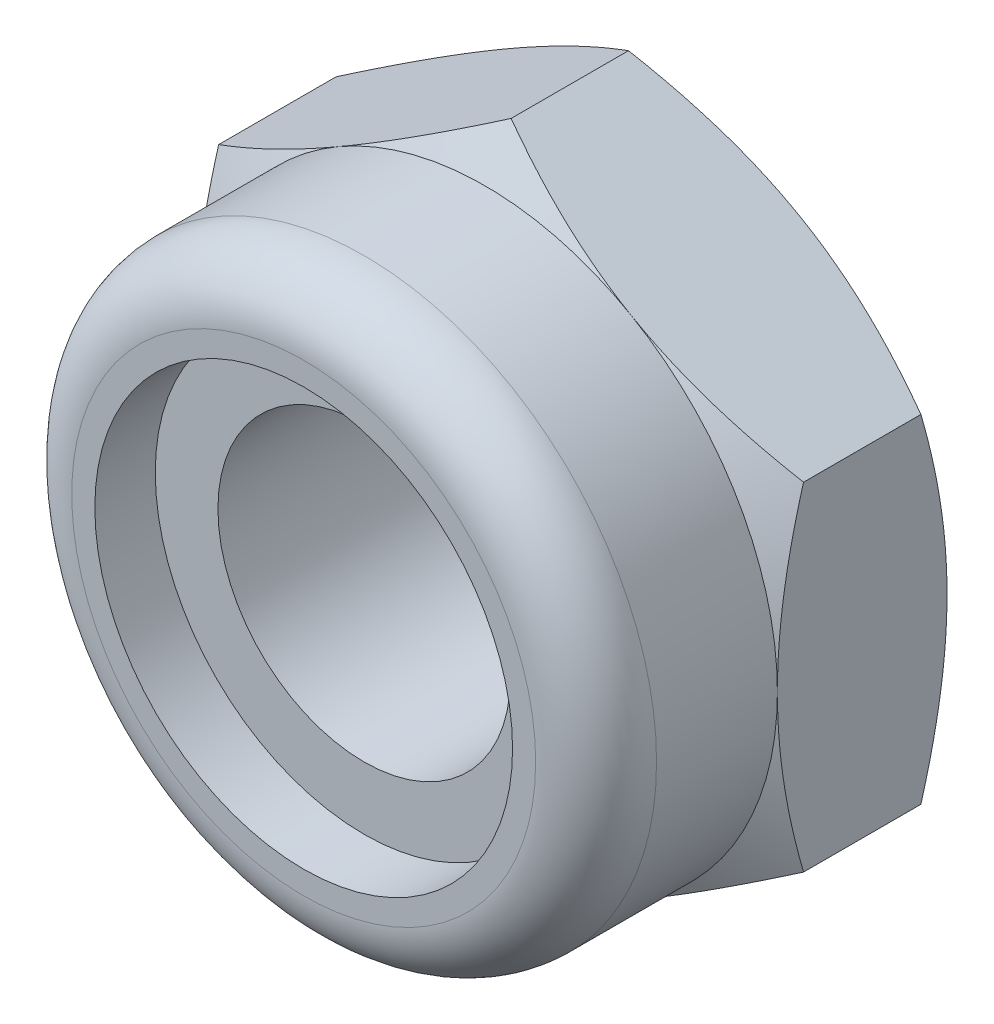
ISO-10303-21;
HEADER;
FILE_DESCRIPTION(('STEP AP214'),'2;1');
FILE_NAME('part.step','',(''),(''),'','','');
FILE_SCHEMA(('AUTOMOTIVE_DESIGN { 1 0 10303 214 1 1 1 1 }'));
ENDSEC;
DATA;
#1=APPLICATION_CONTEXT('core data for automotive mechanical design processes');
#2=APPLICATION_PROTOCOL_DEFINITION('international standard','automotive_design',2000,#1);
#3=PRODUCT_CONTEXT('',#1,'mechanical');
#4=PRODUCT('Part','Part','',(#3));
#5=PRODUCT_RELATED_PRODUCT_CATEGORY('part','',(#4));
#6=PRODUCT_DEFINITION_FORMATION('','',#4);
#7=PRODUCT_DEFINITION_CONTEXT('part definition',#1,'design');
#8=PRODUCT_DEFINITION('design','',#6,#7);
#9=PRODUCT_DEFINITION_SHAPE('','',#8);
#10=(LENGTH_UNIT() NAMED_UNIT(*) SI_UNIT(.MILLI.,.METRE.));
#11=(NAMED_UNIT(*) PLANE_ANGLE_UNIT() SI_UNIT($,.RADIAN.));
#12=(NAMED_UNIT(*) SI_UNIT($,.STERADIAN.) SOLID_ANGLE_UNIT());
#13=UNCERTAINTY_MEASURE_WITH_UNIT(LENGTH_MEASURE(1.E-05),#10,'distance_accuracy_value','');
#14=(GEOMETRIC_REPRESENTATION_CONTEXT(3) GLOBAL_UNCERTAINTY_ASSIGNED_CONTEXT((#13)) GLOBAL_UNIT_ASSIGNED_CONTEXT((#10,
#11,#12)) REPRESENTATION_CONTEXT('',''));
#15=CARTESIAN_POINT('',(0.,0.,0.));
#16=DIRECTION('',(0.,0.,1.));
#17=DIRECTION('',(1.,0.,0.));
#18=AXIS2_PLACEMENT_3D('',#15,#16,#17);
#19=CARTESIAN_POINT('',(0.,0.,-2.9));
#20=DIRECTION('',(0.,0.,1.));
#21=DIRECTION('',(1.,0.,0.));
#22=AXIS2_PLACEMENT_3D('',#19,#20,#21);
#23=CYLINDRICAL_SURFACE('',#22,2.5);
#24=CARTESIAN_POINT('',(0.,0.,2.06666666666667));
#25=DIRECTION('',(0.,0.,1.));
#26=DIRECTION('',(1.,0.,0.));
#27=AXIS2_PLACEMENT_3D('',#24,#25,#26);
#28=CIRCLE('',#27,2.5);
#29=CARTESIAN_POINT('',(2.5,0.,2.06666666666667));
#30=VERTEX_POINT('',#29);
#31=EDGE_CURVE('E274',#30,#30,#28,.T.);
#32=ORIENTED_EDGE('',*,*,#31,.T.);
#33=EDGE_LOOP('',(#32));
#34=FACE_BOUND('',#33,.T.);
#35=CARTESIAN_POINT('',(0.,0.,-2.52449623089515));
#36=DIRECTION('',(0.,0.,-1.));
#37=DIRECTION('',(-1.,0.,0.));
#38=AXIS2_PLACEMENT_3D('',#35,#36,#37);
#39=CIRCLE('',#38,2.5);
#40=CARTESIAN_POINT('',(-2.5,0.,-2.52449623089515));
#41=VERTEX_POINT('',#40);
#42=EDGE_CURVE('E41',#41,#41,#39,.F.);
#43=ORIENTED_EDGE('',*,*,#42,.F.);
#44=EDGE_LOOP('',(#43));
#45=FACE_BOUND('',#44,.T.);
#46=ADVANCED_FACE('F36',(#34,#45),#23,.F.);
#47=CARTESIAN_POINT('',(0.,5.77350269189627,-2.9));
#48=DIRECTION('',(0.,0.,-1.));
#49=DIRECTION('',(-1.,0.,0.));
#50=AXIS2_PLACEMENT_3D('',#47,#48,#49);
#51=PLANE('',#50);
#52=CARTESIAN_POINT('',(0.,0.,-2.9));
#53=DIRECTION('',(0.,0.,-1.));
#54=DIRECTION('',(-1.,0.,0.));
#55=AXIS2_PLACEMENT_3D('',#52,#53,#54);
#56=CIRCLE('',#55,5.);
#57=CARTESIAN_POINT('',(-5.,0.,-2.9));
#58=VERTEX_POINT('',#57);
#59=CARTESIAN_POINT('',(-2.50000000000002,-4.33012701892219,-2.9));
#60=VERTEX_POINT('',#59);
#61=EDGE_CURVE('E146',#58,#60,#56,.F.);
#62=ORIENTED_EDGE('',*,*,#61,.F.);
#63=CARTESIAN_POINT('',(-2.50000000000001,4.33012701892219,-2.9));
#64=VERTEX_POINT('',#63);
#65=EDGE_CURVE('E236',#64,#58,#56,.F.);
#66=ORIENTED_EDGE('',*,*,#65,.F.);
#67=CARTESIAN_POINT('',(2.50000000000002,4.33012701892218,-2.9));
#68=VERTEX_POINT('',#67);
#69=EDGE_CURVE('E251',#68,#64,#56,.F.);
#70=ORIENTED_EDGE('',*,*,#69,.F.);
#71=CARTESIAN_POINT('',(0.,0.,-2.9));
#72=DIRECTION('',(0.,0.,1.));
#73=DIRECTION('',(1.,0.,0.));
#74=AXIS2_PLACEMENT_3D('',#71,#72,#73);
#75=CIRCLE('',#74,5.);
#76=CARTESIAN_POINT('',(5.,0.,-2.9));
#77=VERTEX_POINT('',#76);
#78=EDGE_CURVE('E208',#77,#68,#75,.T.);
#79=ORIENTED_EDGE('',*,*,#78,.F.);
#80=CARTESIAN_POINT('',(2.50000000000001,-4.33012701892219,-2.9));
#81=VERTEX_POINT('',#80);
#82=EDGE_CURVE('E405',#81,#77,#56,.F.);
#83=ORIENTED_EDGE('',*,*,#82,.F.);
#84=EDGE_CURVE('E323',#60,#81,#56,.F.);
#85=ORIENTED_EDGE('',*,*,#84,.F.);
#86=EDGE_LOOP('',(#62,#66,#70,#79,#83,#85));
#87=FACE_BOUND('',#86,.T.);
#88=CARTESIAN_POINT('',(0.,0.,-2.9));
#89=DIRECTION('',(0.,0.,-1.));
#90=DIRECTION('',(-1.,0.,0.));
#91=AXIS2_PLACEMENT_3D('',#88,#89,#90);
#92=CIRCLE('',#91,3.);
#93=CARTESIAN_POINT('',(-3.,0.,-2.9));
#94=VERTEX_POINT('',#93);
#95=EDGE_CURVE('E252',#94,#94,#92,.F.);
#96=ORIENTED_EDGE('',*,*,#95,.T.);
#97=EDGE_LOOP('',(#96));
#98=FACE_BOUND('',#97,.T.);
#99=ADVANCED_FACE('F216',(#87,#98),#51,.T.);
#100=CARTESIAN_POINT('',(0.,5.77350269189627,-2.9));
#101=DIRECTION('',(-0.500000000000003,0.866025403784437,0.));
#102=DIRECTION('',(-0.866025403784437,-0.500000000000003,0.));
#103=AXIS2_PLACEMENT_3D('',#100,#101,#102);
#104=PLANE('',#103);
#105=DIRECTION('',(0.,0.,1.));
#106=VECTOR('',#105,1.);
#107=CARTESIAN_POINT('',(-5.,2.88675134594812,-2.9));
#108=LINE('',#107,#106);
#109=CARTESIAN_POINT('',(-5.,2.88675134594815,-2.45341801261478));
#110=VERTEX_POINT('',#109);
#111=CARTESIAN_POINT('',(-5.,2.88675134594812,-0.446581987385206));
#112=VERTEX_POINT('',#111);
#113=EDGE_CURVE('E247',#110,#112,#108,.T.);
#114=ORIENTED_EDGE('',*,*,#113,.T.);
#115=CARTESIAN_POINT('',(-5.0002,2.88663587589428,-0.446648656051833));
#116=CARTESIAN_POINT('',(-4.78046540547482,3.01349970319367,-0.373386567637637));
#117=CARTESIAN_POINT('',(-4.55885141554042,3.14144859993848,-0.306751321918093));
#118=CARTESIAN_POINT('',(-4.11178600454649,3.3995619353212,-0.190438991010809));
#119=CARTESIAN_POINT('',(-3.88632664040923,3.52973095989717,-0.140803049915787));
#120=CARTESIAN_POINT('',(-3.43816769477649,3.78847564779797,-0.0635510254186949));
#121=CARTESIAN_POINT('',(-3.21553790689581,3.91701101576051,-0.0354203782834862));
#122=CARTESIAN_POINT('',(-2.88081009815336,4.11026620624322,-0.0101949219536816));
#123=CARTESIAN_POINT('',(-2.76915780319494,4.1747286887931,-0.0046134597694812));
#124=CARTESIAN_POINT('',(-2.5457500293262,4.30371322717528,0.000797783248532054));
#125=CARTESIAN_POINT('',(-2.43399455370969,4.36823528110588,0.000627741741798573));
#126=CARTESIAN_POINT('',(-2.12781576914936,4.54500768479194,-0.00775363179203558));
#127=CARTESIAN_POINT('',(-1.93349391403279,4.65719946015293,-0.0218297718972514));
#128=CARTESIAN_POINT('',(-1.54613989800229,4.88083840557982,-0.0664652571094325));
#129=CARTESIAN_POINT('',(-1.35310909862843,4.99228478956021,-0.0970398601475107));
#130=CARTESIAN_POINT('',(-0.964974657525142,5.21637431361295,-0.173468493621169));
#131=CARTESIAN_POINT('',(-0.769920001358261,5.32898917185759,-0.219646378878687));
#132=CARTESIAN_POINT('',(-0.382719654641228,5.55253939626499,-0.324451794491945));
#133=CARTESIAN_POINT('',(-0.190569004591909,5.66347762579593,-0.383054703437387));
#134=CARTESIAN_POINT('',(0.000200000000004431,5.77361816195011,-0.446648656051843));
#135=B_SPLINE_CURVE_WITH_KNOTS('',3,(#115,#116,#117,#118,#119,#120,#121,#122,#123,#124,#125,
#126,#127,#128,#129,#130,#131,#132,#133,#134),.UNSPECIFIED.,.F.,.F.,(4,2,2,2,2,2,2,2,2,4),(0.,
0.792555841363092,1.58701660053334,2.36181537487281,2.74884076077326,3.13585419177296,
3.8096236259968,4.48401723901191,5.1733688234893,5.86136694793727),.UNSPECIFIED.);
#136=CARTESIAN_POINT('',(-2.50000000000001,4.33012701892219,0.));
#137=VERTEX_POINT('',#136);
#138=EDGE_CURVE('E61',#112,#137,#135,.T.);
#139=ORIENTED_EDGE('',*,*,#138,.T.);
#140=CARTESIAN_POINT('',(0.,5.77350269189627,-0.446581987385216));
#141=VERTEX_POINT('',#140);
#142=EDGE_CURVE('E199',#137,#141,#135,.T.);
#143=ORIENTED_EDGE('',*,*,#142,.T.);
#144=DIRECTION('',(0.,0.,1.));
#145=VECTOR('',#144,1.);
#146=CARTESIAN_POINT('',(0.,5.77350269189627,-2.9));
#147=LINE('',#146,#145);
#148=CARTESIAN_POINT('',(0.,5.77350269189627,-2.45341801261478));
#149=VERTEX_POINT('',#148);
#150=EDGE_CURVE('E233',#149,#141,#147,.T.);
#151=ORIENTED_EDGE('',*,*,#150,.F.);
#152=CARTESIAN_POINT('',(-5.0002,2.88663587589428,-2.45335134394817));
#153=CARTESIAN_POINT('',(-4.78046540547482,3.01349970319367,-2.52661343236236));
#154=CARTESIAN_POINT('',(-4.55885141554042,3.14144859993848,-2.59324867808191));
#155=CARTESIAN_POINT('',(-4.11178600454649,3.3995619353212,-2.70956100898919));
#156=CARTESIAN_POINT('',(-3.88632664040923,3.52973095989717,-2.75919695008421));
#157=CARTESIAN_POINT('',(-3.43816769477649,3.78847564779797,-2.8364489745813));
#158=CARTESIAN_POINT('',(-3.21553790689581,3.91701101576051,-2.86457962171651));
#159=CARTESIAN_POINT('',(-2.88081009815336,4.11026620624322,-2.88980507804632));
#160=CARTESIAN_POINT('',(-2.76915780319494,4.1747286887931,-2.89538654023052));
#161=CARTESIAN_POINT('',(-2.5457500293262,4.30371322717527,-2.90079778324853));
#162=CARTESIAN_POINT('',(-2.43399455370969,4.36823528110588,-2.9006277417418));
#163=CARTESIAN_POINT('',(-2.12781576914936,4.54500768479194,-2.89224636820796));
#164=CARTESIAN_POINT('',(-1.93349391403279,4.65719946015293,-2.87817022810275));
#165=CARTESIAN_POINT('',(-1.54613989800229,4.88083840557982,-2.83353474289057));
#166=CARTESIAN_POINT('',(-1.35310909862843,4.99228478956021,-2.80296013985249));
#167=CARTESIAN_POINT('',(-0.964974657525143,5.21637431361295,-2.72653150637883));
#168=CARTESIAN_POINT('',(-0.769920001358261,5.32898917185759,-2.68035362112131));
#169=CARTESIAN_POINT('',(-0.382719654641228,5.55253939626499,-2.57554820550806));
#170=CARTESIAN_POINT('',(-0.190569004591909,5.66347762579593,-2.51694529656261));
#171=CARTESIAN_POINT('',(0.000200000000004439,5.77361816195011,-2.45335134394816));
#172=B_SPLINE_CURVE_WITH_KNOTS('',3,(#152,#153,#154,#155,#156,#157,#158,#159,#160,#161,#162,
#163,#164,#165,#166,#167,#168,#169,#170,#171),.UNSPECIFIED.,.F.,.F.,(4,2,2,2,2,2,2,2,2,4),(0.,
0.792555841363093,1.58701660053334,2.36181537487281,2.74884076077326,3.13585419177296,
3.8096236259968,4.4840172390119,5.1733688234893,5.86136694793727),.UNSPECIFIED.);
#173=EDGE_CURVE('E249',#64,#149,#172,.T.);
#174=ORIENTED_EDGE('',*,*,#173,.F.);
#175=EDGE_CURVE('E228',#110,#64,#172,.T.);
#176=ORIENTED_EDGE('',*,*,#175,.F.);
#177=EDGE_LOOP('',(#114,#139,#143,#151,#174,#176));
#178=FACE_BOUND('',#177,.T.);
#179=ADVANCED_FACE('F38',(#178),#104,.T.);
#180=CARTESIAN_POINT('',(5.,2.88675134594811,-2.9));
#181=DIRECTION('',(0.500000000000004,0.866025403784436,0.));
#182=DIRECTION('',(-0.866025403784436,0.500000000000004,0.));
#183=AXIS2_PLACEMENT_3D('',#180,#181,#182);
#184=PLANE('',#183);
#185=ORIENTED_EDGE('',*,*,#150,.T.);
#186=CARTESIAN_POINT('',(-0.000199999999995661,5.77361816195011,-0.446648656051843));
#187=CARTESIAN_POINT('',(0.21953459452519,5.64675433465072,-0.373386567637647));
#188=CARTESIAN_POINT('',(0.441148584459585,5.51880543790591,-0.306751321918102));
#189=CARTESIAN_POINT('',(0.888213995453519,5.26069210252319,-0.190438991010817));
#190=CARTESIAN_POINT('',(1.11367335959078,5.13052307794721,-0.140803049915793));
#191=CARTESIAN_POINT('',(1.56183230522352,4.87177839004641,-0.063551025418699));
#192=CARTESIAN_POINT('',(1.7844620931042,4.74324302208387,-0.0354203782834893));
#193=CARTESIAN_POINT('',(2.11918990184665,4.54998783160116,-0.0101949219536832));
#194=CARTESIAN_POINT('',(2.23084219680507,4.48552534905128,-0.00461345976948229));
#195=CARTESIAN_POINT('',(2.45424997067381,4.3565408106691,0.000797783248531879));
#196=CARTESIAN_POINT('',(2.56600544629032,4.29201875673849,0.000627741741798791));
#197=CARTESIAN_POINT('',(2.87218423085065,4.11524635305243,-0.00775363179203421));
#198=CARTESIAN_POINT('',(3.06650608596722,4.00305457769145,-0.0218297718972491));
#199=CARTESIAN_POINT('',(3.45386010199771,3.77941563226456,-0.0664652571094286));
#200=CARTESIAN_POINT('',(3.64689090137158,3.66796924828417,-0.0970398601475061));
#201=CARTESIAN_POINT('',(4.03502534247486,3.44387972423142,-0.173468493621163));
#202=CARTESIAN_POINT('',(4.23007999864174,3.33126486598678,-0.21964637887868));
#203=CARTESIAN_POINT('',(4.61728034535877,3.10771464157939,-0.324451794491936));
#204=CARTESIAN_POINT('',(4.80943099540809,2.99677641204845,-0.383054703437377));
#205=CARTESIAN_POINT('',(5.0002,2.88663587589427,-0.446648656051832));
#206=B_SPLINE_CURVE_WITH_KNOTS('',3,(#186,#187,#188,#189,#190,#191,#192,#193,#194,#195,#196,
#197,#198,#199,#200,#201,#202,#203,#204,#205),.UNSPECIFIED.,.F.,.F.,(4,2,2,2,2,2,2,2,2,4),(0.,
0.792555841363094,1.58701660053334,2.36181537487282,2.74884076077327,3.13585419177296,
3.80962362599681,4.48401723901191,5.1733688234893,5.86136694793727),.UNSPECIFIED.);
#207=CARTESIAN_POINT('',(2.50000000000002,4.33012701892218,0.));
#208=VERTEX_POINT('',#207);
#209=EDGE_CURVE('E207',#141,#208,#206,.T.);
#210=ORIENTED_EDGE('',*,*,#209,.T.);
#211=CARTESIAN_POINT('',(5.,2.88675134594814,-0.446581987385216));
#212=VERTEX_POINT('',#211);
#213=EDGE_CURVE('E200',#208,#212,#206,.T.);
#214=ORIENTED_EDGE('',*,*,#213,.T.);
#215=DIRECTION('',(0.,0.,1.));
#216=VECTOR('',#215,1.);
#217=CARTESIAN_POINT('',(5.,2.88675134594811,-2.9));
#218=LINE('',#217,#216);
#219=CARTESIAN_POINT('',(5.,2.88675134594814,-2.45341801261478));
#220=VERTEX_POINT('',#219);
#221=EDGE_CURVE('E237',#220,#212,#218,.T.);
#222=ORIENTED_EDGE('',*,*,#221,.F.);
#223=CARTESIAN_POINT('',(-0.000199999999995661,5.77361816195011,-2.45335134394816));
#224=CARTESIAN_POINT('',(0.219534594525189,5.64675433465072,-2.52661343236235));
#225=CARTESIAN_POINT('',(0.441148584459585,5.5188054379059,-2.5932486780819));
#226=CARTESIAN_POINT('',(0.888213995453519,5.26069210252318,-2.70956100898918));
#227=CARTESIAN_POINT('',(1.11367335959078,5.13052307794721,-2.75919695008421));
#228=CARTESIAN_POINT('',(1.56183230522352,4.87177839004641,-2.8364489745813));
#229=CARTESIAN_POINT('',(1.7844620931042,4.74324302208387,-2.86457962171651));
#230=CARTESIAN_POINT('',(2.11918990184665,4.54998783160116,-2.88980507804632));
#231=CARTESIAN_POINT('',(2.23084219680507,4.48552534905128,-2.89538654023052));
#232=CARTESIAN_POINT('',(2.45424997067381,4.3565408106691,-2.90079778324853));
#233=CARTESIAN_POINT('',(2.56600544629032,4.29201875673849,-2.9006277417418));
#234=CARTESIAN_POINT('',(2.87218423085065,4.11524635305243,-2.89224636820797));
#235=CARTESIAN_POINT('',(3.06650608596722,4.00305457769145,-2.87817022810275));
#236=CARTESIAN_POINT('',(3.45386010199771,3.77941563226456,-2.83353474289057));
#237=CARTESIAN_POINT('',(3.64689090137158,3.66796924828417,-2.80296013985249));
#238=CARTESIAN_POINT('',(4.03502534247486,3.44387972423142,-2.72653150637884));
#239=CARTESIAN_POINT('',(4.23007999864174,3.33126486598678,-2.68035362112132));
#240=CARTESIAN_POINT('',(4.61728034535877,3.10771464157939,-2.57554820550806));
#241=CARTESIAN_POINT('',(4.80943099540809,2.99677641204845,-2.51694529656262));
#242=CARTESIAN_POINT('',(5.0002,2.88663587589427,-2.45335134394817));
#243=B_SPLINE_CURVE_WITH_KNOTS('',3,(#223,#224,#225,#226,#227,#228,#229,#230,#231,#232,#233,
#234,#235,#236,#237,#238,#239,#240,#241,#242),.UNSPECIFIED.,.F.,.F.,(4,2,2,2,2,2,2,2,2,4),(0.,
0.792555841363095,1.58701660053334,2.36181537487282,2.74884076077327,3.13585419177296,
3.80962362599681,4.48401723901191,5.1733688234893,5.86136694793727),.UNSPECIFIED.);
#244=EDGE_CURVE('E220',#68,#220,#243,.T.);
#245=ORIENTED_EDGE('',*,*,#244,.F.);
#246=EDGE_CURVE('E226',#149,#68,#243,.T.);
#247=ORIENTED_EDGE('',*,*,#246,.F.);
#248=EDGE_LOOP('',(#185,#210,#214,#222,#245,#247));
#249=FACE_BOUND('',#248,.T.);
#250=ADVANCED_FACE('F210',(#249),#184,.T.);
#251=CARTESIAN_POINT('',(5.,2.88675134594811,-2.9));
#252=DIRECTION('',(-1.,0.,0.));
#253=DIRECTION('',(0.,0.,1.));
#254=AXIS2_PLACEMENT_3D('',#251,#252,#253);
#255=PLANE('',#254);
#256=CARTESIAN_POINT('',(5.,-7.65608998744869,-2.39263352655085));
#257=CARTESIAN_POINT('',(5.,-7.4365617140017,-2.28654533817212));
#258=CARTESIAN_POINT('',(5.,-7.21651440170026,-2.181511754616));
#259=CARTESIAN_POINT('',(5.,-6.77510105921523,-1.97415643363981));
#260=CARTESIAN_POINT('',(5.,-6.55373480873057,-1.87183516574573));
#261=CARTESIAN_POINT('',(5.,-6.10820714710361,-1.66996807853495));
#262=CARTESIAN_POINT('',(5.,-5.88403698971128,-1.57044149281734));
#263=CARTESIAN_POINT('',(5.,-5.43385418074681,-1.37566323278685));
#264=CARTESIAN_POINT('',(5.,-5.20784162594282,-1.28041133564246));
#265=CARTESIAN_POINT('',(5.,-4.7508088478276,-1.09418830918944));
#266=CARTESIAN_POINT('',(5.,-4.51976121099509,-1.00328409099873));
#267=CARTESIAN_POINT('',(5.,-4.05494053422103,-0.828595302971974));
#268=CARTESIAN_POINT('',(5.,-3.82116719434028,-0.744811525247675));
#269=CARTESIAN_POINT('',(5.,-3.35100416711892,-0.586614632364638));
#270=CARTESIAN_POINT('',(5.,-3.11462125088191,-0.512181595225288));
#271=CARTESIAN_POINT('',(5.,-2.63849247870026,-0.375104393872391));
#272=CARTESIAN_POINT('',(5.,-2.39874771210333,-0.312456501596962));
#273=CARTESIAN_POINT('',(5.,-1.915743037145,-0.201987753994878));
#274=CARTESIAN_POINT('',(5.,-1.67248221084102,-0.15417084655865));
#275=CARTESIAN_POINT('',(5.,-1.18299359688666,-0.0765955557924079));
#276=CARTESIAN_POINT('',(5.,-0.936765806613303,-0.0468371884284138));
#277=CARTESIAN_POINT('',(5.,-0.567032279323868,-0.0176512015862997));
#278=CARTESIAN_POINT('',(5.,-0.444105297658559,-0.0104963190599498));
#279=CARTESIAN_POINT('',(5.,-0.198053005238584,-0.00139545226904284));
#280=CARTESIAN_POINT('',(5.,-0.074927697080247,0.000550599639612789));
#281=CARTESIAN_POINT('',(5.,0.171257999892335,-0.00081847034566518));
#282=CARTESIAN_POINT('',(5.,0.29431839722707,-0.00413211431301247));
#283=CARTESIAN_POINT('',(5.,0.540192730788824,-0.0159365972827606));
#284=CARTESIAN_POINT('',(5.,0.663006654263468,-0.0244276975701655));
#285=CARTESIAN_POINT('',(5.,0.960681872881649,-0.051106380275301));
#286=CARTESIAN_POINT('',(5.,1.13531436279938,-0.0718889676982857));
#287=CARTESIAN_POINT('',(5.,1.48321675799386,-0.122765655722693));
#288=CARTESIAN_POINT('',(5.,1.65648647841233,-0.152860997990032));
#289=CARTESIAN_POINT('',(5.,2.00155426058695,-0.221298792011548));
#290=CARTESIAN_POINT('',(5.,2.17335067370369,-0.2596494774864));
#291=CARTESIAN_POINT('',(5.,2.51518168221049,-0.343428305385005));
#292=CARTESIAN_POINT('',(5.,2.68521638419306,-0.388856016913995));
#293=CARTESIAN_POINT('',(5.,3.02770318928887,-0.486887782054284));
#294=CARTESIAN_POINT('',(5.,3.20011248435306,-0.539640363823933));
#295=CARTESIAN_POINT('',(5.,3.54310870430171,-0.650357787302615));
#296=CARTESIAN_POINT('',(5.,3.71369679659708,-0.708319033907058));
#297=CARTESIAN_POINT('',(5.,4.05236610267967,-0.828256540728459));
#298=CARTESIAN_POINT('',(5.,4.22045602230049,-0.89020836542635));
#299=CARTESIAN_POINT('',(5.,4.55533171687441,-1.0177482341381));
#300=CARTESIAN_POINT('',(5.,4.72211693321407,-1.08333774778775));
#301=CARTESIAN_POINT('',(5.,4.88829623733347,-1.15038625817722));
#302=B_SPLINE_CURVE_WITH_KNOTS('',3,(#256,#257,#258,#259,#260,#261,#262,#263,#264,#265,#266,
#267,#268,#269,#270,#271,#272,#273,#274,#275,#276,#277,#278,#279,#280,#281,#282,#283,#284,#285,
#286,#287,#288,#289,#290,#291,#292,#293,#294,#295,#296,#297,#298,#299,#300,#301),.UNSPECIFIED.,
.F.,.F.,(4,2,2,2,2,2,2,2,2,2,2,2,2,2,2,2,2,2,2,2,2,2,4),(0.,0.731464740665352,1.46305528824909,
2.19883243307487,2.93457117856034,3.67934251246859,4.42419659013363,5.16743580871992,
5.91043951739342,6.65364083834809,7.39684281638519,7.7661541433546,8.13546067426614,
8.5046634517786,8.87388486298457,9.4011854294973,9.92855633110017,10.4564556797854,
10.9843228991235,11.525120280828,12.065547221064,12.6029322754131,13.1405360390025),.UNSPECIFIED.);
#303=CARTESIAN_POINT('',(4.99999999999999,-2.88675134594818,-0.446581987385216));
#304=VERTEX_POINT('',#303);
#305=CARTESIAN_POINT('',(5.,0.,0.));
#306=VERTEX_POINT('',#305);
#307=EDGE_CURVE('E189',#304,#306,#302,.T.);
#308=ORIENTED_EDGE('',*,*,#307,.F.);
#309=DIRECTION('',(0.,0.,1.));
#310=VECTOR('',#309,1.);
#311=CARTESIAN_POINT('',(5.,-2.88675134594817,-2.9));
#312=LINE('',#311,#310);
#313=CARTESIAN_POINT('',(4.99999999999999,-2.88675134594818,-2.45341801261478));
#314=VERTEX_POINT('',#313);
#315=EDGE_CURVE('E240',#314,#304,#312,.T.);
#316=ORIENTED_EDGE('',*,*,#315,.F.);
#317=CARTESIAN_POINT('',(5.,-7.65608998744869,-0.507366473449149));
#318=CARTESIAN_POINT('',(5.,-7.4365617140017,-0.613454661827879));
#319=CARTESIAN_POINT('',(5.,-7.21651440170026,-0.718488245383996));
#320=CARTESIAN_POINT('',(5.,-6.77510105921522,-0.925843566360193));
#321=CARTESIAN_POINT('',(5.,-6.55373480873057,-1.02816483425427));
#322=CARTESIAN_POINT('',(5.,-6.10820714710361,-1.23003192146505));
#323=CARTESIAN_POINT('',(5.,-5.88403698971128,-1.32955850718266));
#324=CARTESIAN_POINT('',(5.,-5.43385418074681,-1.52433676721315));
#325=CARTESIAN_POINT('',(5.,-5.20784162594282,-1.61958866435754));
#326=CARTESIAN_POINT('',(5.,-4.7508088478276,-1.80581169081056));
#327=CARTESIAN_POINT('',(5.,-4.51976121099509,-1.89671590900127));
#328=CARTESIAN_POINT('',(5.,-4.05494053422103,-2.07140469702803));
#329=CARTESIAN_POINT('',(5.,-3.82116719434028,-2.15518847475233));
#330=CARTESIAN_POINT('',(5.,-3.35100416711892,-2.31338536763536));
#331=CARTESIAN_POINT('',(5.,-3.11462125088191,-2.38781840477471));
#332=CARTESIAN_POINT('',(5.,-2.63849247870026,-2.52489560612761));
#333=CARTESIAN_POINT('',(5.,-2.39874771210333,-2.58754349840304));
#334=CARTESIAN_POINT('',(5.,-1.915743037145,-2.69801224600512));
#335=CARTESIAN_POINT('',(5.,-1.67248221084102,-2.74582915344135));
#336=CARTESIAN_POINT('',(5.,-1.18299359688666,-2.82340444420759));
#337=CARTESIAN_POINT('',(5.,-0.936765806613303,-2.85316281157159));
#338=CARTESIAN_POINT('',(5.,-0.567032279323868,-2.8823487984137));
#339=CARTESIAN_POINT('',(5.,-0.444105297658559,-2.88950368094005));
#340=CARTESIAN_POINT('',(5.,-0.198053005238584,-2.89860454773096));
#341=CARTESIAN_POINT('',(5.,-0.0749276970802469,-2.90055059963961));
#342=CARTESIAN_POINT('',(5.,0.171257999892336,-2.89918152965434));
#343=CARTESIAN_POINT('',(5.,0.294318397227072,-2.89586788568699));
#344=CARTESIAN_POINT('',(5.,0.540192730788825,-2.88406340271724));
#345=CARTESIAN_POINT('',(5.,0.663006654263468,-2.87557230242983));
#346=CARTESIAN_POINT('',(5.,0.960681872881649,-2.8488936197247));
#347=CARTESIAN_POINT('',(5.,1.13531436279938,-2.82811103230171));
#348=CARTESIAN_POINT('',(5.,1.48321675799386,-2.77723434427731));
#349=CARTESIAN_POINT('',(5.,1.65648647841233,-2.74713900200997));
#350=CARTESIAN_POINT('',(5.,2.00155426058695,-2.67870120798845));
#351=CARTESIAN_POINT('',(5.,2.17335067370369,-2.6403505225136));
#352=CARTESIAN_POINT('',(5.,2.51518168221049,-2.55657169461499));
#353=CARTESIAN_POINT('',(5.,2.68521638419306,-2.511143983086));
#354=CARTESIAN_POINT('',(5.,3.02770318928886,-2.41311221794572));
#355=CARTESIAN_POINT('',(5.,3.20011248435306,-2.36035963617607));
#356=CARTESIAN_POINT('',(5.,3.54310870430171,-2.24964221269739));
#357=CARTESIAN_POINT('',(5.,3.71369679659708,-2.19168096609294));
#358=CARTESIAN_POINT('',(5.,4.05236610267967,-2.07174345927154));
#359=CARTESIAN_POINT('',(5.,4.22045602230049,-2.00979163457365));
#360=CARTESIAN_POINT('',(5.,4.55533171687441,-1.8822517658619));
#361=CARTESIAN_POINT('',(5.,4.72211693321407,-1.81666225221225));
#362=CARTESIAN_POINT('',(5.,4.88829623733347,-1.74961374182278));
#363=B_SPLINE_CURVE_WITH_KNOTS('',3,(#317,#318,#319,#320,#321,#322,#323,#324,#325,#326,#327,
#328,#329,#330,#331,#332,#333,#334,#335,#336,#337,#338,#339,#340,#341,#342,#343,#344,#345,#346,
#347,#348,#349,#350,#351,#352,#353,#354,#355,#356,#357,#358,#359,#360,#361,#362),.UNSPECIFIED.,
.F.,.F.,(4,2,2,2,2,2,2,2,2,2,2,2,2,2,2,2,2,2,2,2,2,2,4),(0.,0.731464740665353,1.46305528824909,
2.19883243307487,2.93457117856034,3.67934251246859,4.42419659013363,5.16743580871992,
5.91043951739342,6.65364083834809,7.39684281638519,7.7661541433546,8.13546067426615,
8.5046634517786,8.87388486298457,9.40118542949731,9.92855633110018,10.4564556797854,
10.9843228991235,11.525120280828,12.065547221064,12.6029322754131,13.1405360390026),.UNSPECIFIED.);
#364=EDGE_CURVE('E373',#314,#77,#363,.T.);
#365=ORIENTED_EDGE('',*,*,#364,.T.);
#366=EDGE_CURVE('E227',#77,#220,#363,.T.);
#367=ORIENTED_EDGE('',*,*,#366,.T.);
#368=ORIENTED_EDGE('',*,*,#221,.T.);
#369=EDGE_CURVE('E198',#306,#212,#302,.T.);
#370=ORIENTED_EDGE('',*,*,#369,.F.);
#371=EDGE_LOOP('',(#308,#316,#365,#367,#368,#370));
#372=FACE_BOUND('',#371,.T.);
#373=ADVANCED_FACE('F214',(#372),#255,.F.);
#374=CARTESIAN_POINT('',(0.,-5.77350269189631,-2.9));
#375=DIRECTION('',(0.500000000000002,-0.866025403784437,0.));
#376=DIRECTION('',(0.866025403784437,0.500000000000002,0.));
#377=AXIS2_PLACEMENT_3D('',#374,#375,#376);
#378=PLANE('',#377);
#379=ORIENTED_EDGE('',*,*,#315,.T.);
#380=CARTESIAN_POINT('',(5.0002,-2.88663587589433,-0.446648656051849));
#381=CARTESIAN_POINT('',(4.78046540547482,-3.01349970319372,-0.373386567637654));
#382=CARTESIAN_POINT('',(4.55885141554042,-3.14144859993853,-0.30675132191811));
#383=CARTESIAN_POINT('',(4.11178600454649,-3.39956193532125,-0.190438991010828));
#384=CARTESIAN_POINT('',(3.88632664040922,-3.52973095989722,-0.140803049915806));
#385=CARTESIAN_POINT('',(3.43816769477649,-3.78847564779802,-0.0635510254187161));
#386=CARTESIAN_POINT('',(3.2155379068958,-3.91701101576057,-0.0354203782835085));
#387=CARTESIAN_POINT('',(2.88081009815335,-4.11026620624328,-0.0101949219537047));
#388=CARTESIAN_POINT('',(2.76915780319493,-4.17472868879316,-0.0046134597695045));
#389=CARTESIAN_POINT('',(2.54575002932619,-4.30371322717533,0.000797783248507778));
#390=CARTESIAN_POINT('',(2.43399455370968,-4.36823528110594,0.00062774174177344));
#391=CARTESIAN_POINT('',(2.12781576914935,-4.545007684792,-0.00775363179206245));
#392=CARTESIAN_POINT('',(1.93349391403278,-4.65719946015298,-0.0218297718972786));
#393=CARTESIAN_POINT('',(1.54613989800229,-4.88083840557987,-0.0664652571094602));
#394=CARTESIAN_POINT('',(1.35310909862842,-4.99228478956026,-0.0970398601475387));
#395=CARTESIAN_POINT('',(0.964974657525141,-5.216374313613,-0.173468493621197));
#396=CARTESIAN_POINT('',(0.76992000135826,-5.32898917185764,-0.219646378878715));
#397=CARTESIAN_POINT('',(0.382719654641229,-5.55253939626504,-0.324451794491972));
#398=CARTESIAN_POINT('',(0.190569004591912,-5.66347762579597,-0.383054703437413));
#399=CARTESIAN_POINT('',(-0.000200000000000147,-5.77361816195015,-0.446648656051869));
#400=B_SPLINE_CURVE_WITH_KNOTS('',3,(#380,#381,#382,#383,#384,#385,#386,#387,#388,#389,#390,
#391,#392,#393,#394,#395,#396,#397,#398,#399),.UNSPECIFIED.,.F.,.F.,(4,2,2,2,2,2,2,2,2,4),(0.,
0.792555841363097,1.58701660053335,2.36181537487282,2.74884076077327,3.13585419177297,
3.80962362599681,4.48401723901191,5.1733688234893,5.86136694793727),.UNSPECIFIED.);
#401=CARTESIAN_POINT('',(2.50000000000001,-4.33012701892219,0.));
#402=VERTEX_POINT('',#401);
#403=EDGE_CURVE('E367',#304,#402,#400,.T.);
#404=ORIENTED_EDGE('',*,*,#403,.T.);
#405=CARTESIAN_POINT('',(0.,-5.77350269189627,-0.446581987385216));
#406=VERTEX_POINT('',#405);
#407=EDGE_CURVE('E183',#402,#406,#400,.T.);
#408=ORIENTED_EDGE('',*,*,#407,.T.);
#409=DIRECTION('',(0.,0.,1.));
#410=VECTOR('',#409,1.);
#411=CARTESIAN_POINT('',(0.,-5.77350269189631,-2.9));
#412=LINE('',#411,#410);
#413=CARTESIAN_POINT('',(0.,-5.77350269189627,-2.45341801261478));
#414=VERTEX_POINT('',#413);
#415=EDGE_CURVE('E243',#414,#406,#412,.T.);
#416=ORIENTED_EDGE('',*,*,#415,.F.);
#417=CARTESIAN_POINT('',(5.0002,-2.88663587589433,-2.45335134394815));
#418=CARTESIAN_POINT('',(4.78046540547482,-3.01349970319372,-2.52661343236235));
#419=CARTESIAN_POINT('',(4.55885141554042,-3.14144859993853,-2.59324867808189));
#420=CARTESIAN_POINT('',(4.11178600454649,-3.39956193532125,-2.70956100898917));
#421=CARTESIAN_POINT('',(3.88632664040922,-3.52973095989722,-2.75919695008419));
#422=CARTESIAN_POINT('',(3.43816769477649,-3.78847564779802,-2.83644897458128));
#423=CARTESIAN_POINT('',(3.2155379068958,-3.91701101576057,-2.86457962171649));
#424=CARTESIAN_POINT('',(2.88081009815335,-4.11026620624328,-2.8898050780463));
#425=CARTESIAN_POINT('',(2.76915780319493,-4.17472868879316,-2.8953865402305));
#426=CARTESIAN_POINT('',(2.54575002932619,-4.30371322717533,-2.90079778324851));
#427=CARTESIAN_POINT('',(2.43399455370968,-4.36823528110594,-2.90062774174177));
#428=CARTESIAN_POINT('',(2.12781576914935,-4.545007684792,-2.89224636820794));
#429=CARTESIAN_POINT('',(1.93349391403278,-4.65719946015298,-2.87817022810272));
#430=CARTESIAN_POINT('',(1.54613989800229,-4.88083840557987,-2.83353474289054));
#431=CARTESIAN_POINT('',(1.35310909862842,-4.99228478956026,-2.80296013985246));
#432=CARTESIAN_POINT('',(0.964974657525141,-5.216374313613,-2.7265315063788));
#433=CARTESIAN_POINT('',(0.76992000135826,-5.32898917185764,-2.68035362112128));
#434=CARTESIAN_POINT('',(0.38271965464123,-5.55253939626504,-2.57554820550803));
#435=CARTESIAN_POINT('',(0.190569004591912,-5.66347762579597,-2.51694529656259));
#436=CARTESIAN_POINT('',(-0.000200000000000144,-5.77361816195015,-2.45335134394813));
#437=B_SPLINE_CURVE_WITH_KNOTS('',3,(#417,#418,#419,#420,#421,#422,#423,#424,#425,#426,#427,
#428,#429,#430,#431,#432,#433,#434,#435,#436),.UNSPECIFIED.,.F.,.F.,(4,2,2,2,2,2,2,2,2,4),(0.,
0.792555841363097,1.58701660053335,2.36181537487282,2.74884076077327,3.13585419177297,
3.80962362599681,4.48401723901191,5.1733688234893,5.86136694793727),.UNSPECIFIED.);
#438=EDGE_CURVE('E345',#81,#414,#437,.T.);
#439=ORIENTED_EDGE('',*,*,#438,.F.);
#440=EDGE_CURVE('E369',#314,#81,#437,.T.);
#441=ORIENTED_EDGE('',*,*,#440,.F.);
#442=EDGE_LOOP('',(#379,#404,#408,#416,#439,#441));
#443=FACE_BOUND('',#442,.T.);
#444=ADVANCED_FACE('F352',(#443),#378,.T.);
#445=CARTESIAN_POINT('',(-5.,-2.88675134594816,-2.9));
#446=DIRECTION('',(-0.500000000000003,-0.866025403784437,0.));
#447=DIRECTION('',(0.866025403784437,-0.500000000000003,0.));
#448=AXIS2_PLACEMENT_3D('',#445,#446,#447);
#449=PLANE('',#448);
#450=ORIENTED_EDGE('',*,*,#415,.T.);
#451=CARTESIAN_POINT('',(0.000199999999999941,-5.77361816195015,-0.446648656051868));
#452=CARTESIAN_POINT('',(-0.219534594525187,-5.64675433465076,-0.373386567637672));
#453=CARTESIAN_POINT('',(-0.441148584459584,-5.51880543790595,-0.306751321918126));
#454=CARTESIAN_POINT('',(-0.888213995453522,-5.26069210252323,-0.19043899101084));
#455=CARTESIAN_POINT('',(-1.11367335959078,-5.13052307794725,-0.140803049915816));
#456=CARTESIAN_POINT('',(-1.56183230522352,-4.87177839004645,-0.063551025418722));
#457=CARTESIAN_POINT('',(-1.78446209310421,-4.74324302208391,-0.0354203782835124));
#458=CARTESIAN_POINT('',(-2.11918990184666,-4.5499878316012,-0.0101949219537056));
#459=CARTESIAN_POINT('',(-2.23084219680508,-4.48552534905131,-0.00461345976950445));
#460=CARTESIAN_POINT('',(-2.45424997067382,-4.35654081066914,0.000797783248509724));
#461=CARTESIAN_POINT('',(-2.56600544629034,-4.29201875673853,0.000627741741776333));
#462=CARTESIAN_POINT('',(-2.87218423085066,-4.11524635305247,-0.00775363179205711));
#463=CARTESIAN_POINT('',(-3.06650608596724,-4.00305457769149,-0.0218297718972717));
#464=CARTESIAN_POINT('',(-3.45386010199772,-3.7794156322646,-0.0664652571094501));
#465=CARTESIAN_POINT('',(-3.64689090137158,-3.66796924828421,-0.097039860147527));
#466=CARTESIAN_POINT('',(-4.03502534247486,-3.44387972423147,-0.173468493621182));
#467=CARTESIAN_POINT('',(-4.23007999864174,-3.33126486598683,-0.219646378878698));
#468=CARTESIAN_POINT('',(-4.61728034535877,-3.10771464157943,-0.324451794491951));
#469=CARTESIAN_POINT('',(-4.80943099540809,-2.9967764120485,-0.38305470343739));
#470=CARTESIAN_POINT('',(-5.0002,-2.88663587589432,-0.446648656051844));
#471=B_SPLINE_CURVE_WITH_KNOTS('',3,(#451,#452,#453,#454,#455,#456,#457,#458,#459,#460,#461,
#462,#463,#464,#465,#466,#467,#468,#469,#470),.UNSPECIFIED.,.F.,.F.,(4,2,2,2,2,2,2,2,2,4),(0.,
0.792555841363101,1.58701660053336,2.36181537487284,2.74884076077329,3.13585419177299,
3.80962362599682,4.48401723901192,5.17336882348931,5.86136694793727),.UNSPECIFIED.);
#472=CARTESIAN_POINT('',(-2.50000000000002,-4.33012701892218,0.));
#473=VERTEX_POINT('',#472);
#474=EDGE_CURVE('E152',#406,#473,#471,.T.);
#475=ORIENTED_EDGE('',*,*,#474,.T.);
#476=CARTESIAN_POINT('',(-5.,-2.88675134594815,-0.446581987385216));
#477=VERTEX_POINT('',#476);
#478=EDGE_CURVE('E143',#473,#477,#471,.T.);
#479=ORIENTED_EDGE('',*,*,#478,.T.);
#480=DIRECTION('',(0.,0.,1.));
#481=VECTOR('',#480,1.);
#482=CARTESIAN_POINT('',(-5.,-2.88675134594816,-2.9));
#483=LINE('',#482,#481);
#484=CARTESIAN_POINT('',(-5.,-2.88675134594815,-2.45341801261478));
#485=VERTEX_POINT('',#484);
#486=EDGE_CURVE('E151',#485,#477,#483,.T.);
#487=ORIENTED_EDGE('',*,*,#486,.F.);
#488=CARTESIAN_POINT('',(0.000199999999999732,-5.77361816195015,-2.45335134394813));
#489=CARTESIAN_POINT('',(-0.219534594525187,-5.64675433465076,-2.52661343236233));
#490=CARTESIAN_POINT('',(-0.441148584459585,-5.51880543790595,-2.59324867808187));
#491=CARTESIAN_POINT('',(-0.888213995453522,-5.26069210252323,-2.70956100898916));
#492=CARTESIAN_POINT('',(-1.11367335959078,-5.13052307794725,-2.75919695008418));
#493=CARTESIAN_POINT('',(-1.56183230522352,-4.87177839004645,-2.83644897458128));
#494=CARTESIAN_POINT('',(-1.78446209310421,-4.74324302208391,-2.86457962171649));
#495=CARTESIAN_POINT('',(-2.11918990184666,-4.5499878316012,-2.88980507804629));
#496=CARTESIAN_POINT('',(-2.23084219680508,-4.48552534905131,-2.8953865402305));
#497=CARTESIAN_POINT('',(-2.45424997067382,-4.35654081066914,-2.90079778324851));
#498=CARTESIAN_POINT('',(-2.56600544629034,-4.29201875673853,-2.90062774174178));
#499=CARTESIAN_POINT('',(-2.87218423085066,-4.11524635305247,-2.89224636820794));
#500=CARTESIAN_POINT('',(-3.06650608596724,-4.00305457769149,-2.87817022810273));
#501=CARTESIAN_POINT('',(-3.45386010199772,-3.7794156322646,-2.83353474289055));
#502=CARTESIAN_POINT('',(-3.64689090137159,-3.66796924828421,-2.80296013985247));
#503=CARTESIAN_POINT('',(-4.03502534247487,-3.44387972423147,-2.72653150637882));
#504=CARTESIAN_POINT('',(-4.23007999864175,-3.33126486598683,-2.6803536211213));
#505=CARTESIAN_POINT('',(-4.61728034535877,-3.10771464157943,-2.57554820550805));
#506=CARTESIAN_POINT('',(-4.80943099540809,-2.9967764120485,-2.51694529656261));
#507=CARTESIAN_POINT('',(-5.0002,-2.88663587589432,-2.45335134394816));
#508=B_SPLINE_CURVE_WITH_KNOTS('',3,(#488,#489,#490,#491,#492,#493,#494,#495,#496,#497,#498,
#499,#500,#501,#502,#503,#504,#505,#506,#507),.UNSPECIFIED.,.F.,.F.,(4,2,2,2,2,2,2,2,2,4),(0.,
0.792555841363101,1.58701660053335,2.36181537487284,2.74884076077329,3.13585419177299,
3.80962362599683,4.48401723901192,5.17336882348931,5.86136694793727),.UNSPECIFIED.);
#509=EDGE_CURVE('E334',#60,#485,#508,.T.);
#510=ORIENTED_EDGE('',*,*,#509,.F.);
#511=EDGE_CURVE('E344',#414,#60,#508,.T.);
#512=ORIENTED_EDGE('',*,*,#511,.F.);
#513=EDGE_LOOP('',(#450,#475,#479,#487,#510,#512));
#514=FACE_BOUND('',#513,.T.);
#515=ADVANCED_FACE('F349',(#514),#449,.T.);
#516=CARTESIAN_POINT('',(-5.,2.88675134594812,-2.9));
#517=DIRECTION('',(-1.,0.,0.));
#518=DIRECTION('',(0.,0.,1.));
#519=AXIS2_PLACEMENT_3D('',#516,#517,#518);
#520=PLANE('',#519);
#521=ORIENTED_EDGE('',*,*,#486,.T.);
#522=CARTESIAN_POINT('',(-5.,-7.65608998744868,-2.39263352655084));
#523=CARTESIAN_POINT('',(-5.,-7.43656171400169,-2.28654533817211));
#524=CARTESIAN_POINT('',(-5.,-7.21651440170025,-2.181511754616));
#525=CARTESIAN_POINT('',(-5.,-6.77510105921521,-1.9741564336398));
#526=CARTESIAN_POINT('',(-5.,-6.55373480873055,-1.87183516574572));
#527=CARTESIAN_POINT('',(-5.,-6.1082071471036,-1.66996807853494));
#528=CARTESIAN_POINT('',(-5.,-5.88403698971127,-1.57044149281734));
#529=CARTESIAN_POINT('',(-5.,-5.4338541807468,-1.37566323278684));
#530=CARTESIAN_POINT('',(-5.,-5.20784162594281,-1.28041133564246));
#531=CARTESIAN_POINT('',(-5.,-4.75080884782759,-1.09418830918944));
#532=CARTESIAN_POINT('',(-5.,-4.51976121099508,-1.00328409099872));
#533=CARTESIAN_POINT('',(-5.,-4.05494053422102,-0.82859530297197));
#534=CARTESIAN_POINT('',(-5.,-3.82116719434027,-0.74481152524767));
#535=CARTESIAN_POINT('',(-5.,-3.35100416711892,-0.586614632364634));
#536=CARTESIAN_POINT('',(-5.,-3.1146212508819,-0.512181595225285));
#537=CARTESIAN_POINT('',(-5.,-2.63849247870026,-0.375104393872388));
#538=CARTESIAN_POINT('',(-5.,-2.39874771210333,-0.312456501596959));
#539=CARTESIAN_POINT('',(-5.,-1.91574303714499,-0.201987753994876));
#540=CARTESIAN_POINT('',(-5.,-1.67248221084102,-0.154170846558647));
#541=CARTESIAN_POINT('',(-5.,-1.18299359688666,-0.0765955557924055));
#542=CARTESIAN_POINT('',(-5.,-0.9367658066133,-0.046837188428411));
#543=CARTESIAN_POINT('',(-5.,-0.567032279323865,-0.0176512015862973));
#544=CARTESIAN_POINT('',(-5.,-0.444105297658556,-0.0104963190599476));
#545=CARTESIAN_POINT('',(-5.,-0.198053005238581,-0.00139545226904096));
#546=CARTESIAN_POINT('',(-5.,-0.0749276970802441,0.000550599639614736));
#547=CARTESIAN_POINT('',(-5.,0.171257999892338,-0.000818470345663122));
#548=CARTESIAN_POINT('',(-5.,0.294318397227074,-0.00413211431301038));
#549=CARTESIAN_POINT('',(-5.,0.540192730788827,-0.0159365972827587));
#550=CARTESIAN_POINT('',(-5.,0.663006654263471,-0.0244276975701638));
#551=CARTESIAN_POINT('',(-5.,0.960681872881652,-0.0511063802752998));
#552=CARTESIAN_POINT('',(-5.,1.13531436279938,-0.0718889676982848));
#553=CARTESIAN_POINT('',(-5.,1.48321675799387,-0.122765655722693));
#554=CARTESIAN_POINT('',(-5.,1.65648647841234,-0.152860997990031));
#555=CARTESIAN_POINT('',(-5.,2.00155426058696,-0.221298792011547));
#556=CARTESIAN_POINT('',(-5.,2.1733506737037,-0.2596494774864));
#557=CARTESIAN_POINT('',(-5.,2.5151816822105,-0.343428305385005));
#558=CARTESIAN_POINT('',(-5.,2.68521638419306,-0.388856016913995));
#559=CARTESIAN_POINT('',(-5.,3.02770318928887,-0.486887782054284));
#560=CARTESIAN_POINT('',(-5.,3.20011248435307,-0.539640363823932));
#561=CARTESIAN_POINT('',(-5.,3.54310870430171,-0.650357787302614));
#562=CARTESIAN_POINT('',(-5.,3.71369679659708,-0.708319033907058));
#563=CARTESIAN_POINT('',(-5.,4.05236610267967,-0.82825654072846));
#564=CARTESIAN_POINT('',(-5.,4.22045602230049,-0.89020836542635));
#565=CARTESIAN_POINT('',(-5.,4.55533171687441,-1.0177482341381));
#566=CARTESIAN_POINT('',(-5.,4.72211693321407,-1.08333774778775));
#567=CARTESIAN_POINT('',(-5.,4.88829623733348,-1.15038625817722));
#568=B_SPLINE_CURVE_WITH_KNOTS('',3,(#522,#523,#524,#525,#526,#527,#528,#529,#530,#531,#532,
#533,#534,#535,#536,#537,#538,#539,#540,#541,#542,#543,#544,#545,#546,#547,#548,#549,#550,#551,
#552,#553,#554,#555,#556,#557,#558,#559,#560,#561,#562,#563,#564,#565,#566,#567),.UNSPECIFIED.,
.F.,.F.,(4,2,2,2,2,2,2,2,2,2,2,2,2,2,2,2,2,2,2,2,2,2,4),(0.,0.731464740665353,1.46305528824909,
2.19883243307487,2.93457117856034,3.67934251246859,4.42419659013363,5.16743580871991,
5.91043951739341,6.65364083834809,7.39684281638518,7.76615414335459,8.13546067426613,
8.50466345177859,8.87388486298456,9.4011854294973,9.92855633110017,10.4564556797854,
10.9843228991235,11.525120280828,12.065547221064,12.6029322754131,13.1405360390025),.UNSPECIFIED.);
#569=CARTESIAN_POINT('',(-5.,0.,0.));
#570=VERTEX_POINT('',#569);
#571=EDGE_CURVE('E136',#477,#570,#568,.T.);
#572=ORIENTED_EDGE('',*,*,#571,.T.);
#573=EDGE_CURVE('E130',#570,#112,#568,.T.);
#574=ORIENTED_EDGE('',*,*,#573,.T.);
#575=ORIENTED_EDGE('',*,*,#113,.F.);
#576=CARTESIAN_POINT('',(-5.,-7.65608998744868,-0.507366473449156));
#577=CARTESIAN_POINT('',(-5.,-7.43656171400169,-0.613454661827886));
#578=CARTESIAN_POINT('',(-5.,-7.21651440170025,-0.718488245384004));
#579=CARTESIAN_POINT('',(-5.,-6.77510105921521,-0.925843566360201));
#580=CARTESIAN_POINT('',(-5.,-6.55373480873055,-1.02816483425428));
#581=CARTESIAN_POINT('',(-5.,-6.1082071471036,-1.23003192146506));
#582=CARTESIAN_POINT('',(-5.,-5.88403698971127,-1.32955850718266));
#583=CARTESIAN_POINT('',(-5.,-5.4338541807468,-1.52433676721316));
#584=CARTESIAN_POINT('',(-5.,-5.20784162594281,-1.61958866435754));
#585=CARTESIAN_POINT('',(-5.,-4.75080884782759,-1.80581169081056));
#586=CARTESIAN_POINT('',(-5.,-4.51976121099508,-1.89671590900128));
#587=CARTESIAN_POINT('',(-5.,-4.05494053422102,-2.07140469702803));
#588=CARTESIAN_POINT('',(-5.,-3.82116719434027,-2.15518847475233));
#589=CARTESIAN_POINT('',(-5.,-3.35100416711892,-2.31338536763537));
#590=CARTESIAN_POINT('',(-5.,-3.1146212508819,-2.38781840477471));
#591=CARTESIAN_POINT('',(-5.,-2.63849247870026,-2.52489560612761));
#592=CARTESIAN_POINT('',(-5.,-2.39874771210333,-2.58754349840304));
#593=CARTESIAN_POINT('',(-5.,-1.91574303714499,-2.69801224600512));
#594=CARTESIAN_POINT('',(-5.,-1.67248221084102,-2.74582915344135));
#595=CARTESIAN_POINT('',(-5.,-1.18299359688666,-2.82340444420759));
#596=CARTESIAN_POINT('',(-5.,-0.9367658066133,-2.85316281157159));
#597=CARTESIAN_POINT('',(-5.,-0.567032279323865,-2.8823487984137));
#598=CARTESIAN_POINT('',(-5.,-0.444105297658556,-2.88950368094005));
#599=CARTESIAN_POINT('',(-5.,-0.198053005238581,-2.89860454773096));
#600=CARTESIAN_POINT('',(-5.,-0.074927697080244,-2.90055059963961));
#601=CARTESIAN_POINT('',(-5.,0.171257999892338,-2.89918152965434));
#602=CARTESIAN_POINT('',(-5.,0.294318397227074,-2.89586788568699));
#603=CARTESIAN_POINT('',(-5.,0.540192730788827,-2.88406340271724));
#604=CARTESIAN_POINT('',(-5.,0.663006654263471,-2.87557230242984));
#605=CARTESIAN_POINT('',(-5.,0.960681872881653,-2.8488936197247));
#606=CARTESIAN_POINT('',(-5.,1.13531436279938,-2.82811103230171));
#607=CARTESIAN_POINT('',(-5.,1.48321675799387,-2.77723434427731));
#608=CARTESIAN_POINT('',(-5.,1.65648647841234,-2.74713900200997));
#609=CARTESIAN_POINT('',(-5.,2.00155426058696,-2.67870120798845));
#610=CARTESIAN_POINT('',(-5.,2.1733506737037,-2.6403505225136));
#611=CARTESIAN_POINT('',(-5.,2.5151816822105,-2.55657169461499));
#612=CARTESIAN_POINT('',(-5.,2.68521638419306,-2.51114398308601));
#613=CARTESIAN_POINT('',(-5.,3.02770318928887,-2.41311221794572));
#614=CARTESIAN_POINT('',(-5.,3.20011248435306,-2.36035963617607));
#615=CARTESIAN_POINT('',(-5.,3.54310870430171,-2.24964221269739));
#616=CARTESIAN_POINT('',(-5.,3.71369679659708,-2.19168096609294));
#617=CARTESIAN_POINT('',(-5.,4.05236610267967,-2.07174345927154));
#618=CARTESIAN_POINT('',(-5.,4.22045602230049,-2.00979163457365));
#619=CARTESIAN_POINT('',(-5.,4.55533171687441,-1.8822517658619));
#620=CARTESIAN_POINT('',(-5.,4.72211693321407,-1.81666225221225));
#621=CARTESIAN_POINT('',(-5.,4.88829623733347,-1.74961374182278));
#622=B_SPLINE_CURVE_WITH_KNOTS('',3,(#576,#577,#578,#579,#580,#581,#582,#583,#584,#585,#586,
#587,#588,#589,#590,#591,#592,#593,#594,#595,#596,#597,#598,#599,#600,#601,#602,#603,#604,#605,
#606,#607,#608,#609,#610,#611,#612,#613,#614,#615,#616,#617,#618,#619,#620,#621),.UNSPECIFIED.,
.F.,.F.,(4,2,2,2,2,2,2,2,2,2,2,2,2,2,2,2,2,2,2,2,2,2,4),(0.,0.731464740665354,1.46305528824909,
2.19883243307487,2.93457117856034,3.67934251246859,4.42419659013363,5.16743580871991,
5.91043951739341,6.65364083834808,7.39684281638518,7.76615414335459,8.13546067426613,
8.50466345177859,8.87388486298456,9.40118542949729,9.92855633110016,10.4564556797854,
10.9843228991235,11.525120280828,12.065547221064,12.602932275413,13.1405360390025),.UNSPECIFIED.);
#623=EDGE_CURVE('E331',#58,#110,#622,.T.);
#624=ORIENTED_EDGE('',*,*,#623,.F.);
#625=EDGE_CURVE('E333',#485,#58,#622,.T.);
#626=ORIENTED_EDGE('',*,*,#625,.F.);
#627=EDGE_LOOP('',(#521,#572,#574,#575,#624,#626));
#628=FACE_BOUND('',#627,.T.);
#629=ADVANCED_FACE('F148',(#628),#520,.T.);
#630=CARTESIAN_POINT('',(0.,0.,-2.9));
#631=DIRECTION('',(0.,0.,1.));
#632=DIRECTION('',(1.,0.,0.));
#633=AXIS2_PLACEMENT_3D('',#630,#631,#632);
#634=CONICAL_SURFACE('',#633,5.,1.04719755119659);
#635=ORIENTED_EDGE('',*,*,#175,.T.);
#636=ORIENTED_EDGE('',*,*,#65,.T.);
#637=ORIENTED_EDGE('',*,*,#623,.T.);
#638=EDGE_LOOP('',(#635,#636,#637));
#639=FACE_BOUND('',#638,.T.);
#640=ADVANCED_FACE('F329',(#639),#634,.T.);
#641=ORIENTED_EDGE('',*,*,#173,.T.);
#642=ORIENTED_EDGE('',*,*,#246,.T.);
#643=ORIENTED_EDGE('',*,*,#69,.T.);
#644=EDGE_LOOP('',(#641,#642,#643));
#645=FACE_BOUND('',#644,.T.);
#646=ADVANCED_FACE('F403',(#645),#634,.T.);
#647=ORIENTED_EDGE('',*,*,#244,.T.);
#648=ORIENTED_EDGE('',*,*,#366,.F.);
#649=ORIENTED_EDGE('',*,*,#78,.T.);
#650=EDGE_LOOP('',(#647,#648,#649));
#651=FACE_BOUND('',#650,.T.);
#652=ADVANCED_FACE('F407',(#651),#634,.T.);
#653=ORIENTED_EDGE('',*,*,#440,.T.);
#654=ORIENTED_EDGE('',*,*,#82,.T.);
#655=ORIENTED_EDGE('',*,*,#364,.F.);
#656=EDGE_LOOP('',(#653,#654,#655));
#657=FACE_BOUND('',#656,.T.);
#658=ADVANCED_FACE('F406',(#657),#634,.T.);
#659=ORIENTED_EDGE('',*,*,#438,.T.);
#660=ORIENTED_EDGE('',*,*,#511,.T.);
#661=ORIENTED_EDGE('',*,*,#84,.T.);
#662=EDGE_LOOP('',(#659,#660,#661));
#663=FACE_BOUND('',#662,.T.);
#664=ADVANCED_FACE('F393',(#663),#634,.T.);
#665=ORIENTED_EDGE('',*,*,#509,.T.);
#666=ORIENTED_EDGE('',*,*,#625,.T.);
#667=ORIENTED_EDGE('',*,*,#61,.T.);
#668=EDGE_LOOP('',(#665,#666,#667));
#669=FACE_BOUND('',#668,.T.);
#670=ADVANCED_FACE('F171',(#669),#634,.T.);
#671=CARTESIAN_POINT('',(0.,0.,0.));
#672=DIRECTION('',(0.,0.,-1.));
#673=DIRECTION('',(-1.,0.,0.));
#674=AXIS2_PLACEMENT_3D('',#671,#672,#673);
#675=CONICAL_SURFACE('',#674,5.,1.04719755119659);
#676=CARTESIAN_POINT('',(0.,0.,0.));
#677=DIRECTION('',(0.,0.,-1.));
#678=DIRECTION('',(-1.,0.,0.));
#679=AXIS2_PLACEMENT_3D('',#676,#677,#678);
#680=CIRCLE('',#679,5.);
#681=EDGE_CURVE('E48',#473,#570,#680,.T.);
#682=ORIENTED_EDGE('',*,*,#681,.T.);
#683=ORIENTED_EDGE('',*,*,#571,.F.);
#684=ORIENTED_EDGE('',*,*,#478,.F.);
#685=EDGE_LOOP('',(#682,#683,#684));
#686=FACE_BOUND('',#685,.T.);
#687=ADVANCED_FACE('F141',(#686),#675,.T.);
#688=EDGE_CURVE('E145',#402,#473,#680,.T.);
#689=ORIENTED_EDGE('',*,*,#688,.T.);
#690=ORIENTED_EDGE('',*,*,#474,.F.);
#691=ORIENTED_EDGE('',*,*,#407,.F.);
#692=EDGE_LOOP('',(#689,#690,#691));
#693=FACE_BOUND('',#692,.T.);
#694=ADVANCED_FACE('F170',(#693),#675,.T.);
#695=ORIENTED_EDGE('',*,*,#307,.T.);
#696=EDGE_CURVE('E397',#306,#402,#680,.T.);
#697=ORIENTED_EDGE('',*,*,#696,.T.);
#698=ORIENTED_EDGE('',*,*,#403,.F.);
#699=EDGE_LOOP('',(#695,#697,#698));
#700=FACE_BOUND('',#699,.T.);
#701=ADVANCED_FACE('F526',(#700),#675,.T.);
#702=CARTESIAN_POINT('',(0.,0.,0.));
#703=DIRECTION('',(0.,0.,1.));
#704=DIRECTION('',(1.,0.,0.));
#705=AXIS2_PLACEMENT_3D('',#702,#703,#704);
#706=CIRCLE('',#705,5.);
#707=EDGE_CURVE('E137',#306,#208,#706,.T.);
#708=ORIENTED_EDGE('',*,*,#707,.F.);
#709=ORIENTED_EDGE('',*,*,#369,.T.);
#710=ORIENTED_EDGE('',*,*,#213,.F.);
#711=EDGE_LOOP('',(#708,#709,#710));
#712=FACE_BOUND('',#711,.T.);
#713=ADVANCED_FACE('F381',(#712),#675,.T.);
#714=EDGE_CURVE('E46',#137,#208,#680,.T.);
#715=ORIENTED_EDGE('',*,*,#714,.T.);
#716=ORIENTED_EDGE('',*,*,#209,.F.);
#717=ORIENTED_EDGE('',*,*,#142,.F.);
#718=EDGE_LOOP('',(#715,#716,#717));
#719=FACE_BOUND('',#718,.T.);
#720=ADVANCED_FACE('F172',(#719),#675,.T.);
#721=ORIENTED_EDGE('',*,*,#573,.F.);
#722=EDGE_CURVE('E11',#570,#137,#680,.T.);
#723=ORIENTED_EDGE('',*,*,#722,.T.);
#724=ORIENTED_EDGE('',*,*,#138,.F.);
#725=EDGE_LOOP('',(#721,#723,#724));
#726=FACE_BOUND('',#725,.T.);
#727=ADVANCED_FACE('F131',(#726),#675,.T.);
#728=CARTESIAN_POINT('',(0.,0.,-2.8746));
#729=DIRECTION('',(0.,0.,-1.));
#730=DIRECTION('',(-1.,0.,0.));
#731=AXIS2_PLACEMENT_3D('',#728,#729,#730);
#732=CONICAL_SURFACE('',#731,3.,0.959931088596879);
#733=CARTESIAN_POINT('',(0.,0.,-2.8746));
#734=DIRECTION('',(0.,0.,1.));
#735=DIRECTION('',(1.,0.,0.));
#736=AXIS2_PLACEMENT_3D('',#733,#734,#735);
#737=CIRCLE('',#736,3.);
#738=CARTESIAN_POINT('',(3.,0.,-2.8746));
#739=VERTEX_POINT('',#738);
#740=EDGE_CURVE('E254',#739,#739,#737,.T.);
#741=ORIENTED_EDGE('',*,*,#740,.F.);
#742=EDGE_LOOP('',(#741));
#743=FACE_BOUND('',#742,.T.);
#744=ORIENTED_EDGE('',*,*,#42,.T.);
#745=EDGE_LOOP('',(#744));
#746=FACE_BOUND('',#745,.T.);
#747=ADVANCED_FACE('F492',(#743,#746),#732,.F.);
#748=CARTESIAN_POINT('',(0.,0.,19.05));
#749=DIRECTION('',(0.,0.,1.));
#750=DIRECTION('',(1.,0.,0.));
#751=AXIS2_PLACEMENT_3D('',#748,#749,#750);
#752=CYLINDRICAL_SURFACE('',#751,3.);
#753=ORIENTED_EDGE('',*,*,#95,.F.);
#754=EDGE_LOOP('',(#753));
#755=FACE_BOUND('',#754,.T.);
#756=ORIENTED_EDGE('',*,*,#740,.T.);
#757=EDGE_LOOP('',(#756));
#758=FACE_BOUND('',#757,.T.);
#759=ADVANCED_FACE('F173',(#755,#758),#752,.F.);
#760=CARTESIAN_POINT('',(0.,2.5,2.06666666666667));
#761=DIRECTION('',(0.,0.,-1.));
#762=DIRECTION('',(-1.,0.,0.));
#763=AXIS2_PLACEMENT_3D('',#760,#761,#762);
#764=PLANE('',#763);
#765=ORIENTED_EDGE('',*,*,#31,.F.);
#766=EDGE_LOOP('',(#765));
#767=FACE_BOUND('',#766,.T.);
#768=CARTESIAN_POINT('',(0.,0.,2.06666666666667));
#769=DIRECTION('',(0.,0.,1.));
#770=DIRECTION('',(1.,0.,0.));
#771=AXIS2_PLACEMENT_3D('',#768,#769,#770);
#772=CIRCLE('',#771,3.57142857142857);
#773=CARTESIAN_POINT('',(3.57142857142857,0.,2.06666666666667));
#774=VERTEX_POINT('',#773);
#775=EDGE_CURVE('E259',#774,#774,#772,.T.);
#776=ORIENTED_EDGE('',*,*,#775,.T.);
#777=EDGE_LOOP('',(#776));
#778=FACE_BOUND('',#777,.T.);
#779=ADVANCED_FACE('F280',(#767,#778),#764,.F.);
#780=CARTESIAN_POINT('',(0.,0.,9.48088822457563));
#781=DIRECTION('',(0.,0.,1.));
#782=DIRECTION('',(1.,0.,0.));
#783=AXIS2_PLACEMENT_3D('',#780,#781,#782);
#784=CYLINDRICAL_SURFACE('',#783,3.57142857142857);
#785=ORIENTED_EDGE('',*,*,#775,.F.);
#786=EDGE_LOOP('',(#785));
#787=FACE_BOUND('',#786,.T.);
#788=CARTESIAN_POINT('',(0.,0.,3.1));
#789=DIRECTION('',(0.,0.,1.));
#790=DIRECTION('',(1.,0.,0.));
#791=AXIS2_PLACEMENT_3D('',#788,#789,#790);
#792=CIRCLE('',#791,3.57142857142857);
#793=CARTESIAN_POINT('',(3.57142857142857,0.,3.1));
#794=VERTEX_POINT('',#793);
#795=EDGE_CURVE('E263',#794,#794,#792,.T.);
#796=ORIENTED_EDGE('',*,*,#795,.T.);
#797=EDGE_LOOP('',(#796));
#798=FACE_BOUND('',#797,.T.);
#799=ADVANCED_FACE('F283',(#787,#798),#784,.F.);
#800=CARTESIAN_POINT('',(0.,3.57142857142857,3.1));
#801=DIRECTION('',(0.,0.,-1.));
#802=DIRECTION('',(-1.,0.,0.));
#803=AXIS2_PLACEMENT_3D('',#800,#801,#802);
#804=PLANE('',#803);
#805=ORIENTED_EDGE('',*,*,#795,.F.);
#806=EDGE_LOOP('',(#805));
#807=FACE_BOUND('',#806,.T.);
#808=CARTESIAN_POINT('',(0.,0.,3.1));
#809=DIRECTION('',(0.,0.,1.));
#810=DIRECTION('',(1.,0.,0.));
#811=AXIS2_PLACEMENT_3D('',#808,#809,#810);
#812=CIRCLE('',#811,3.96666666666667);
#813=CARTESIAN_POINT('',(3.96666666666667,0.,3.1));
#814=VERTEX_POINT('',#813);
#815=EDGE_CURVE('E268',#814,#814,#812,.T.);
#816=ORIENTED_EDGE('',*,*,#815,.T.);
#817=EDGE_LOOP('',(#816));
#818=FACE_BOUND('',#817,.T.);
#819=ADVANCED_FACE('F289',(#807,#818),#804,.F.);
#820=CARTESIAN_POINT('',(0.,0.,2.06666666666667));
#821=DIRECTION('',(0.,0.,1.));
#822=DIRECTION('',(1.,0.,0.));
#823=AXIS2_PLACEMENT_3D('',#820,#821,#822);
#824=TOROIDAL_SURFACE('',#823,3.96666666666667,1.03333333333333);
#825=ORIENTED_EDGE('',*,*,#815,.F.);
#826=EDGE_LOOP('',(#825));
#827=FACE_BOUND('',#826,.T.);
#828=CARTESIAN_POINT('',(0.,0.,2.06666666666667));
#829=DIRECTION('',(0.,0.,1.));
#830=DIRECTION('',(1.,0.,0.));
#831=AXIS2_PLACEMENT_3D('',#828,#829,#830);
#832=CIRCLE('',#831,5.);
#833=CARTESIAN_POINT('',(5.,0.,2.06666666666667));
#834=VERTEX_POINT('',#833);
#835=EDGE_CURVE('E271',#834,#834,#832,.T.);
#836=ORIENTED_EDGE('',*,*,#835,.T.);
#837=EDGE_LOOP('',(#836));
#838=FACE_BOUND('',#837,.T.);
#839=ADVANCED_FACE('F295',(#827,#838),#824,.T.);
#840=CARTESIAN_POINT('',(0.,0.,9.48088822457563));
#841=DIRECTION('',(0.,0.,1.));
#842=DIRECTION('',(1.,0.,0.));
#843=AXIS2_PLACEMENT_3D('',#840,#841,#842);
#844=CYLINDRICAL_SURFACE('',#843,5.);
#845=ORIENTED_EDGE('',*,*,#681,.F.);
#846=ORIENTED_EDGE('',*,*,#688,.F.);
#847=ORIENTED_EDGE('',*,*,#696,.F.);
#848=ORIENTED_EDGE('',*,*,#707,.T.);
#849=ORIENTED_EDGE('',*,*,#714,.F.);
#850=ORIENTED_EDGE('',*,*,#722,.F.);
#851=EDGE_LOOP('',(#845,#846,#847,#848,#849,#850));
#852=FACE_BOUND('',#851,.T.);
#853=ORIENTED_EDGE('',*,*,#835,.F.);
#854=EDGE_LOOP('',(#853));
#855=FACE_BOUND('',#854,.T.);
#856=ADVANCED_FACE('F126',(#852,#855),#844,.T.);
#857=CLOSED_SHELL('',(#46,#99,#179,#250,#373,#444,#515,#629,#640,#646,#652,#658,#664,#670,#687,
#694,#701,#713,#720,#727,#747,#759,#779,#799,#819,#839,#856));
#858=MANIFOLD_SOLID_BREP('B2',#857);
#859=ADVANCED_BREP_SHAPE_REPRESENTATION('',(#18,#858),#14);
#860=SHAPE_DEFINITION_REPRESENTATION(#9,#859);
ENDSEC;
END-ISO-10303-21;
